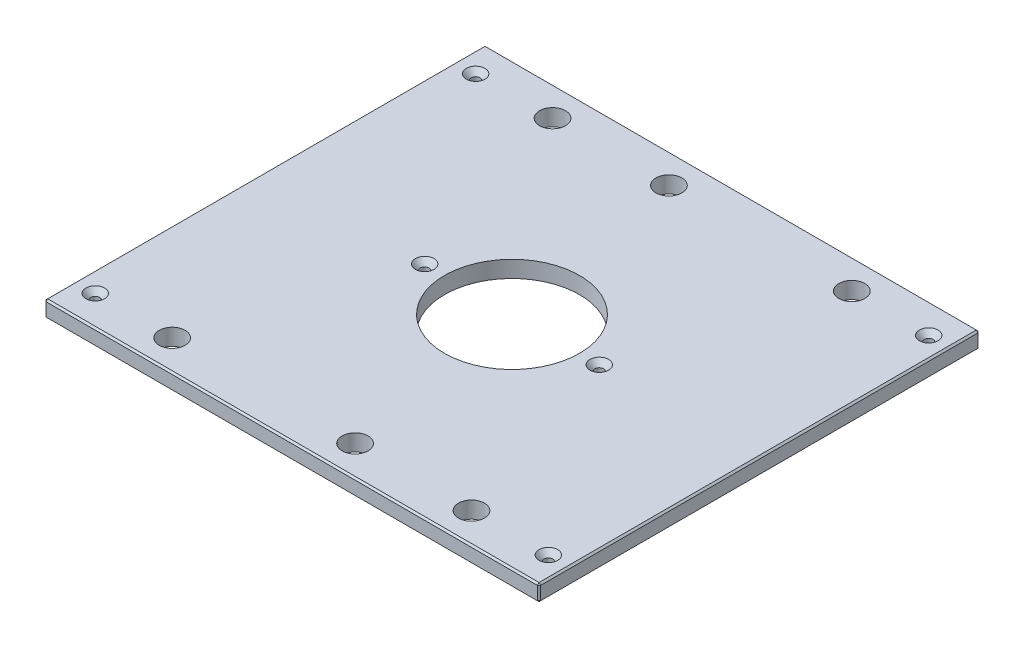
from build123d import *

# Parameters (mm, degrees)
SKETCH1_W                                        = 377.825
SKETCH1_H                                        = 336.55
BOSS_EXTRUDE1_DEPTH                              = 12.7
SKETCH13_R                                       = 51.562
CUT_EXTRUDE6_DEPTH                               = 254.3094911
F_25_32_0_78125_DIAMETER_HOLE1_D                 = 19.84375
CHAMFER2_SIZE                                    = 1.27
CSK_FOR_1_4_FLAT_HEAD_MACHINE_SCREW1_D           = 6.7564
CSK_FOR_1_4_FLAT_HEAD_MACHINE_SCREW1_CSINK_D     = 14.2748
CSK_FOR_1_4_FLAT_HEAD_MACHINE_SCREW1_CSINK_ANGLE = 82


with BuildPart() as part:
    # Sketch1 → Boss-Extrude1 (new body)
    with BuildSketch(Plane(origin=(0, 0, 0), x_dir=(1, 0, 0), z_dir=(0, 1, 0))):
        Rectangle(SKETCH1_W, SKETCH1_H)
    extrude(amount=BOSS_EXTRUDE1_DEPTH)

    # Sketch13 → Cut-Extrude6 (cut, through all)
    with BuildSketch(Plane(origin=(0, 12.7, 0), x_dir=(1, 0, 0), z_dir=(0, 1, 0))):
        with Locations(Location((0, 0, 0), (0, 0, 270))):
            Circle(SKETCH13_R)
    extrude(amount=-CUT_EXTRUDE6_DEPTH, mode=Mode.SUBTRACT)

    # 25_32 _0.78125_ Diameter Hole1 (through all)
    with Locations(Plane(origin=(0, 12.7, 0), x_dir=(1, 0, 0), z_dir=(0, 1, 0))):
        with Locations((114.3, 145.25498), (-114.3, 145.25498), (114.3, -145.25498), (-114.3, -145.25498), (-25.4, 145.25498), (25.4, -145.25498)):
            Hole(F_25_32_0_78125_DIAMETER_HOLE1_D / 2)

    # Chamfer2
    chamfer2_edges = [part.edges().sort_by_distance(p)[0] for p in [
        (188.9125, 12.7, 0),
        (0, 12.7, -168.275),
        (-188.9125, 12.7, 0),
        (0, 0, -168.275),
        (188.9125, 0, 0),
        (0, 0, 168.275),
        (-188.9125, 0, 0),
        (0, 12.7, 168.275),
        (-188.9125, 6.35, -168.275),
        (188.9125, 6.35, -168.275),
        (188.9125, 6.35, 168.275),
        (-188.9125, 6.35, 168.275),
    ]]
    chamfer(chamfer2_edges, length=CHAMFER2_SIZE)

    # CSK for 1_4 Flat Head Machine Screw1 (through all)
    with Locations(Plane(origin=(0, 12.7, 0), x_dir=(1, 0, 0), z_dir=(0, 1, 0))):
        with Locations((173.0375, 145.25498), (173.0375, -145.25498), (-173.0375, -145.25498), (-66.675, 0), (66.675, 0), (-173.0375, 145.25498), (-114.3, 145.25498), (-114.3, -145.25498)):
            CounterSinkHole(CSK_FOR_1_4_FLAT_HEAD_MACHINE_SCREW1_D / 2, CSK_FOR_1_4_FLAT_HEAD_MACHINE_SCREW1_CSINK_D / 2, counter_sink_angle=CSK_FOR_1_4_FLAT_HEAD_MACHINE_SCREW1_CSINK_ANGLE)


solid = part.part
